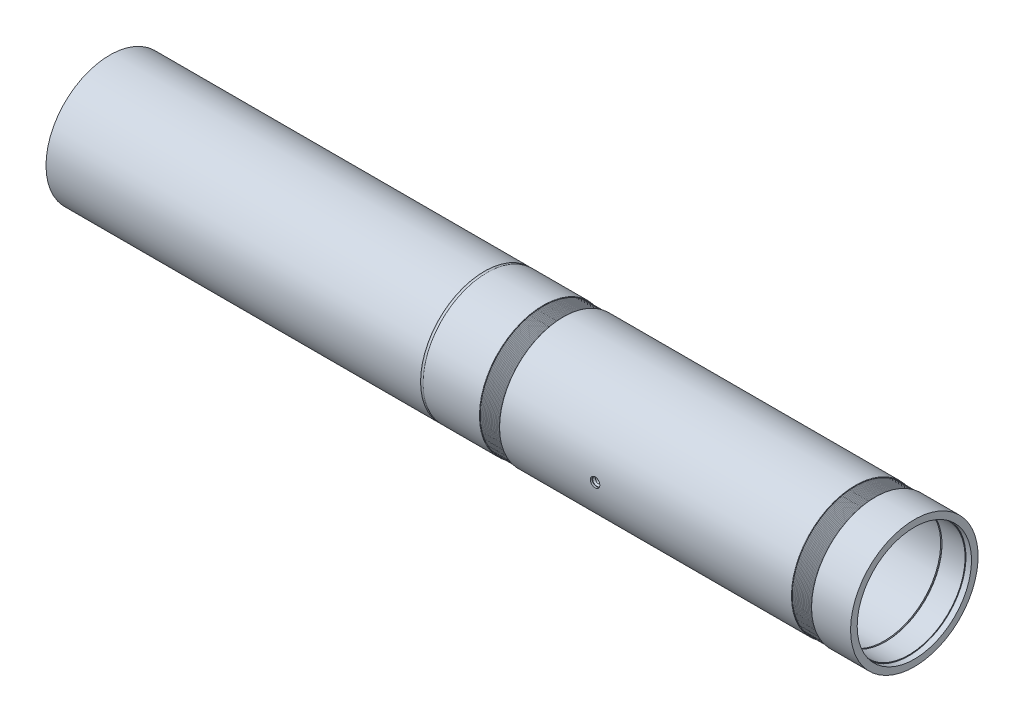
from build123d import *


with BuildPart() as part:
    # Sketch1 → Base-Revolve (revolve)
    with BuildSketch(Plane.XY, mode=Mode.PRIVATE) as base_revolve_sk:
        with BuildLine():
            Line((7.62, 73.0377), (37.2491, 73.0377))
            Line((37.2491, 73.0377), (37.2491, 74.8538))
            Line((37.2491, 74.8538), (38.9509, 74.8538))
            Line((38.9509, 74.8538), (38.9509, 73.0377))
            Line((38.9509, 73.0377), (286.6136, 73.0377))
            Line((286.6136, 73.0377), (286.6136, 74.8538))
            Line((286.6136, 74.8538), (288.3154, 74.8538))
            Line((288.3154, 74.8538), (288.3154, 73.0377))
            Line((288.3154, 73.0377), (753.0973, 73.0377))
            Line((753.0973, 73.0377), (753.0973, 74.8538))
            Line((753.0973, 74.8538), (754.7991, 74.8538))
            Line((754.7991, 74.8538), (754.7991, 73.0377))
            Line((754.7991, 73.0377), (1002.4491, 73.0377))
            Line((1002.4491, 73.0377), (1002.4491, 74.8538))
            Line((1002.4491, 74.8538), (1004.1509, 74.8538))
            Line((1004.1509, 74.8538), (1004.1509, 73.0377))
            Line((1004.1509, 73.0377), (1034.034, 73.0377))
            Line((1034.034, 73.0377), (1034.034, 73.7235))
            ThreePointArc((1034.034, 73.7235), (1034.108394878, 73.903105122), (1034.288, 73.9775))
            Line((1034.288, 73.9775), (1041.4, 73.9775))
            Line((1041.4, 73.9775), (1041.4, 82.5627))
            Line((1041.4, 82.5627), (1004.1509, 82.5627))
            Line((1004.1509, 82.5627), (1002.4491, 82.5627))
            Line((1002.4491, 82.5627), (990.981, 82.5627))
            ThreePointArc((990.981, 82.5627), (990.711592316, 82.451107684), (990.6, 82.1817))
            Line((990.6, 82.1817), (990.6, 81.8007))
            Line((990.6, 81.8007), (989.80625, 80.425884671))
            Line((989.80625, 80.425884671), (989.0125, 81.8007))
            Line((989.0125, 81.8007), (988.21875, 80.425884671))
            Line((988.21875, 80.425884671), (987.425, 81.8007))
            Line((987.425, 81.8007), (986.63125, 80.425884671))
            Line((986.63125, 80.425884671), (985.8375, 81.8007))
            Line((985.8375, 81.8007), (985.04375, 80.425884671))
            Line((985.04375, 80.425884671), (984.25, 81.8007))
            Line((984.25, 81.8007), (983.45625, 80.425884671))
            Line((983.45625, 80.425884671), (982.6625, 81.8007))
            Line((982.6625, 81.8007), (981.86875, 80.425884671))
            Line((981.86875, 80.425884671), (981.075, 81.8007))
            Line((981.075, 81.8007), (980.28125, 80.425884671))
            Line((980.28125, 80.425884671), (979.4875, 81.8007))
            Line((979.4875, 81.8007), (978.69375, 80.425884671))
            Line((978.69375, 80.425884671), (977.9, 81.8007))
            Line((977.9, 81.8007), (977.10625, 80.425884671))
            Line((977.10625, 80.425884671), (976.3125, 81.8007))
            Line((976.3125, 81.8007), (975.51875, 80.425884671))
            Line((975.51875, 80.425884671), (974.725, 81.8007))
            Line((974.725, 81.8007), (973.93125, 80.425884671))
            Line((973.93125, 80.425884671), (973.1375, 81.8007))
            Line((973.1375, 81.8007), (972.34375, 80.425884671))
            Line((972.34375, 80.425884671), (971.55, 81.8007))
            Line((971.55, 81.8007), (970.75625, 80.425884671))
            Line((970.75625, 80.425884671), (969.9625, 81.8007))
            Line((969.9625, 81.8007), (969.16875, 80.425884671))
            Line((969.16875, 80.425884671), (968.375, 81.8007))
            Line((968.375, 81.8007), (967.58125, 80.425884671))
            Line((967.58125, 80.425884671), (966.7875, 81.8007))
            Line((966.7875, 81.8007), (965.99375, 80.425884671))
            Line((965.99375, 80.425884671), (965.2, 81.8007))
            Line((965.2, 81.8007), (965.2, 82.1817))
            ThreePointArc((965.2, 82.1817), (965.088407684, 82.451107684), (964.819, 82.5627))
            Line((964.819, 82.5627), (587.121, 82.5627))
            ThreePointArc((587.121, 82.5627), (586.851592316, 82.451107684), (586.74, 82.1817))
            Line((586.74, 82.1817), (586.74, 81.8007))
            Line((586.74, 81.8007), (585.94625, 80.425884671))
            Line((585.94625, 80.425884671), (585.1525, 81.8007))
            Line((585.1525, 81.8007), (584.35875, 80.425884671))
            Line((584.35875, 80.425884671), (583.565, 81.8007))
            Line((583.565, 81.8007), (582.77125, 80.425884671))
            Line((582.77125, 80.425884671), (581.9775, 81.8007))
            Line((581.9775, 81.8007), (581.18375, 80.425884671))
            Line((581.18375, 80.425884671), (580.39, 81.8007))
            Line((580.39, 81.8007), (579.59625, 80.425884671))
            Line((579.59625, 80.425884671), (578.8025, 81.8007))
            Line((578.8025, 81.8007), (578.00875, 80.425884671))
            Line((578.00875, 80.425884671), (577.215, 81.8007))
            Line((577.215, 81.8007), (576.42125, 80.425884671))
            Line((576.42125, 80.425884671), (575.6275, 81.8007))
            Line((575.6275, 81.8007), (574.83375, 80.425884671))
            Line((574.83375, 80.425884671), (574.04, 81.8007))
            Line((574.04, 81.8007), (573.24625, 80.425884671))
            Line((573.24625, 80.425884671), (572.4525, 81.8007))
            Line((572.4525, 81.8007), (571.65875, 80.425884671))
            Line((571.65875, 80.425884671), (570.865, 81.8007))
            Line((570.865, 81.8007), (570.07125, 80.425884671))
            Line((570.07125, 80.425884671), (569.2775, 81.8007))
            Line((569.2775, 81.8007), (568.48375, 80.425884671))
            Line((568.48375, 80.425884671), (567.69, 81.8007))
            Line((567.69, 81.8007), (566.89625, 80.425884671))
            Line((566.89625, 80.425884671), (566.1025, 81.8007))
            Line((566.1025, 81.8007), (565.30875, 80.425884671))
            Line((565.30875, 80.425884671), (564.515, 81.8007))
            Line((564.515, 81.8007), (563.72125, 80.425884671))
            Line((563.72125, 80.425884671), (562.9275, 81.8007))
            Line((562.9275, 81.8007), (562.13375, 80.425884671))
            Line((562.13375, 80.425884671), (561.34, 81.8007))
            Line((561.34, 81.8007), (561.34, 82.1817))
            ThreePointArc((561.34, 82.1817), (561.228407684, 82.451107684), (560.959, 82.5627))
            Line((560.959, 82.5627), (488.000291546, 82.5627))
            ThreePointArc((488.000291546, 82.5627), (486.41, 81.5467), (484.819708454, 82.5627))
            Line((484.819708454, 82.5627), (0, 82.5627))
            Line((0, 82.5627), (0, 73.9775))
            Line((0, 73.9775), (7.112, 73.9775))
            ThreePointArc((7.112, 73.9775), (7.291605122, 73.903105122), (7.366, 73.7235))
            Line((7.366, 73.7235), (7.366, 73.2917))
            ThreePointArc((7.366, 73.2917), (7.440394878, 73.112094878), (7.62, 73.0377))
        make_face()
    revolve(base_revolve_sk.sketch.rotate(Axis((0, 0, 0), (1, 0, 0)), 90), axis=Axis((0, 0, 0), (1, 0, 0)))

    # Sketch4 → Cut-Revolve5 (revolve, cut)
    with BuildSketch(Plane(origin=(710.692, 0, 0), x_dir=(0, 0, -1), z_dir=(1, 0, 0)), mode=Mode.PRIVATE) as cut_revolve5_sk:
        with BuildLine():
            Line((-78.3971, 3.4544), (-72.955964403, 3.4544))
            ThreePointArc((-72.955964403, 3.4544), (-73.017263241, 1.727683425), (-73.0377, 0))
            Line((-73.0377, 0), (-82.5627, 0))
            Line((-82.5627, 0), (-82.5627, 6.1595))
            Line((-82.5627, 6.1595), (-80.2767, 6.1595))
            Line((-80.2767, 6.1595), (-80.2767, 5.334))
            Line((-80.2767, 5.334), (-78.3971, 3.4544))
        make_face()
    revolve(cut_revolve5_sk.sketch.rotate(Axis((710.692, 0, 82.5627), (0, 0, -1)), 90), axis=Axis((710.692, 0, 82.5627), (0, 0, -1)), mode=Mode.SUBTRACT)


solid = part.part
